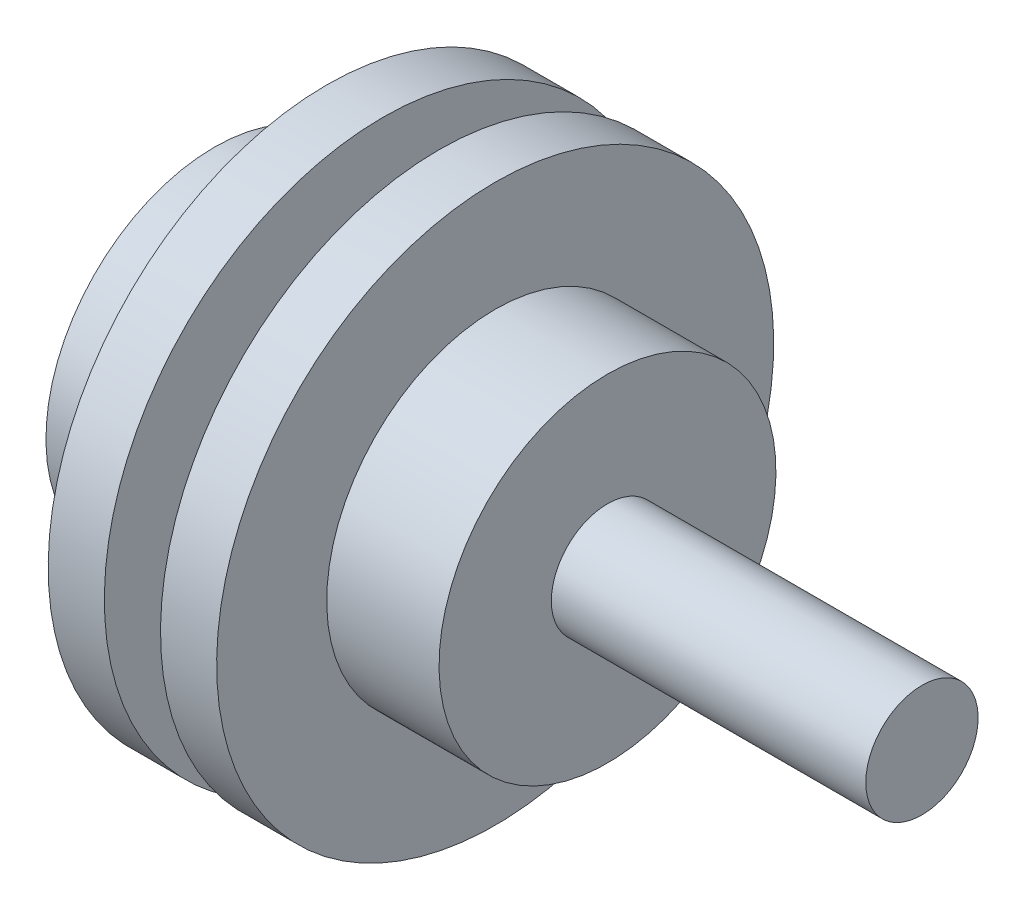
ISO-10303-21;
HEADER;
FILE_DESCRIPTION(('STEP AP214'),'2;1');
FILE_NAME('part.step','',(''),(''),'','','');
FILE_SCHEMA(('AUTOMOTIVE_DESIGN { 1 0 10303 214 1 1 1 1 }'));
ENDSEC;
DATA;
#1=APPLICATION_CONTEXT('core data for automotive mechanical design processes');
#2=APPLICATION_PROTOCOL_DEFINITION('international standard','automotive_design',2000,#1);
#3=PRODUCT_CONTEXT('',#1,'mechanical');
#4=PRODUCT('Part','Part','',(#3));
#5=PRODUCT_RELATED_PRODUCT_CATEGORY('part','',(#4));
#6=PRODUCT_DEFINITION_FORMATION('','',#4);
#7=PRODUCT_DEFINITION_CONTEXT('part definition',#1,'design');
#8=PRODUCT_DEFINITION('design','',#6,#7);
#9=PRODUCT_DEFINITION_SHAPE('','',#8);
#10=(LENGTH_UNIT() NAMED_UNIT(*) SI_UNIT(.MILLI.,.METRE.));
#11=(NAMED_UNIT(*) PLANE_ANGLE_UNIT() SI_UNIT($,.RADIAN.));
#12=(NAMED_UNIT(*) SI_UNIT($,.STERADIAN.) SOLID_ANGLE_UNIT());
#13=UNCERTAINTY_MEASURE_WITH_UNIT(LENGTH_MEASURE(1.E-05),#10,'distance_accuracy_value','');
#14=(GEOMETRIC_REPRESENTATION_CONTEXT(3) GLOBAL_UNCERTAINTY_ASSIGNED_CONTEXT((#13)) GLOBAL_UNIT_ASSIGNED_CONTEXT((#10,
#11,#12)) REPRESENTATION_CONTEXT('',''));
#15=CARTESIAN_POINT('',(0.,0.,0.));
#16=DIRECTION('',(0.,0.,1.));
#17=DIRECTION('',(1.,0.,0.));
#18=AXIS2_PLACEMENT_3D('',#15,#16,#17);
#19=CARTESIAN_POINT('',(-12.7,-19.05,0.));
#20=DIRECTION('',(0.999999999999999,0.,0.));
#21=DIRECTION('',(0.,1.,0.));
#22=AXIS2_PLACEMENT_3D('',#19,#20,#21);
#23=PLANE('',#22);
#24=CARTESIAN_POINT('',(-12.7,-19.05,0.));
#25=DIRECTION('',(0.999999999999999,0.,0.));
#26=DIRECTION('',(0.,1.,0.));
#27=AXIS2_PLACEMENT_3D('',#24,#25,#26);
#28=CIRCLE('',#27,19.05);
#29=CARTESIAN_POINT('',(-12.7,0.,0.));
#30=VERTEX_POINT('',#29);
#31=EDGE_CURVE('E47',#30,#30,#28,.T.);
#32=ORIENTED_EDGE('',*,*,#31,.F.);
#33=EDGE_LOOP('',(#32));
#34=FACE_BOUND('',#33,.T.);
#35=ADVANCED_FACE('F44',(#34),#23,.F.);
#36=CARTESIAN_POINT('',(31.7499999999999,-19.0499999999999,0.));
#37=DIRECTION('',(0.999999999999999,0.,0.));
#38=DIRECTION('',(0.,1.,0.));
#39=AXIS2_PLACEMENT_3D('',#36,#37,#38);
#40=CYLINDRICAL_SURFACE('',#39,19.05);
#41=CARTESIAN_POINT('',(0.,-19.05,0.));
#42=DIRECTION('',(0.999999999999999,0.,0.));
#43=DIRECTION('',(0.,1.,0.));
#44=AXIS2_PLACEMENT_3D('',#41,#42,#43);
#45=CIRCLE('',#44,19.05);
#46=CARTESIAN_POINT('',(0.,0.,0.));
#47=VERTEX_POINT('',#46);
#48=EDGE_CURVE('E55',#47,#47,#45,.T.);
#49=CARTESIAN_POINT('',(0.,0.,0.));
#50=CARTESIAN_POINT('',(-0.132291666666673,0.,0.));
#51=CARTESIAN_POINT('',(-0.264583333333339,0.,0.));
#52=CARTESIAN_POINT('',(-0.529166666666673,0.,0.));
#53=CARTESIAN_POINT('',(-0.661458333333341,0.,0.));
#54=CARTESIAN_POINT('',(-0.926041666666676,0.,0.));
#55=CARTESIAN_POINT('',(-1.05833333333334,0.,0.));
#56=CARTESIAN_POINT('',(-1.32291666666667,0.,0.));
#57=CARTESIAN_POINT('',(-1.45520833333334,0.,0.));
#58=CARTESIAN_POINT('',(-1.71979166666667,0.,0.));
#59=CARTESIAN_POINT('',(-1.85208333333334,0.,0.));
#60=CARTESIAN_POINT('',(-2.11666666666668,0.,0.));
#61=CARTESIAN_POINT('',(-2.24895833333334,0.,0.));
#62=CARTESIAN_POINT('',(-2.51354166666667,0.,0.));
#63=CARTESIAN_POINT('',(-2.64583333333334,0.,0.));
#64=CARTESIAN_POINT('',(-2.91041666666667,0.,0.));
#65=CARTESIAN_POINT('',(-3.04270833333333,0.,0.));
#66=CARTESIAN_POINT('',(-3.30729166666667,0.,0.));
#67=CARTESIAN_POINT('',(-3.43958333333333,0.,0.));
#68=CARTESIAN_POINT('',(-3.70416666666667,0.,0.));
#69=CARTESIAN_POINT('',(-3.83645833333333,0.,0.));
#70=CARTESIAN_POINT('',(-4.10104166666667,0.,0.));
#71=CARTESIAN_POINT('',(-4.23333333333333,0.,0.));
#72=CARTESIAN_POINT('',(-4.49791666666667,0.,0.));
#73=CARTESIAN_POINT('',(-4.63020833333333,0.,0.));
#74=CARTESIAN_POINT('',(-4.89479166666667,0.,0.));
#75=CARTESIAN_POINT('',(-5.02708333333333,0.,0.));
#76=CARTESIAN_POINT('',(-5.29166666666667,0.,0.));
#77=CARTESIAN_POINT('',(-5.42395833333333,0.,0.));
#78=CARTESIAN_POINT('',(-5.68854166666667,0.,0.));
#79=CARTESIAN_POINT('',(-5.82083333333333,0.,0.));
#80=CARTESIAN_POINT('',(-6.08541666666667,0.,0.));
#81=CARTESIAN_POINT('',(-6.21770833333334,0.,0.));
#82=CARTESIAN_POINT('',(-6.48229166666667,0.,0.));
#83=CARTESIAN_POINT('',(-6.61458333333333,0.,0.));
#84=CARTESIAN_POINT('',(-6.87916666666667,0.,0.));
#85=CARTESIAN_POINT('',(-7.01145833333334,0.,0.));
#86=CARTESIAN_POINT('',(-7.27604166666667,0.,0.));
#87=CARTESIAN_POINT('',(-7.40833333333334,0.,0.));
#88=CARTESIAN_POINT('',(-7.67291666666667,0.,0.));
#89=CARTESIAN_POINT('',(-7.80520833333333,0.,0.));
#90=CARTESIAN_POINT('',(-8.06979166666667,0.,0.));
#91=CARTESIAN_POINT('',(-8.20208333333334,0.,0.));
#92=CARTESIAN_POINT('',(-8.46666666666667,0.,0.));
#93=CARTESIAN_POINT('',(-8.59895833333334,0.,0.));
#94=CARTESIAN_POINT('',(-8.86354166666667,0.,0.));
#95=CARTESIAN_POINT('',(-8.99583333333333,0.,0.));
#96=CARTESIAN_POINT('',(-9.26041666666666,0.,0.));
#97=CARTESIAN_POINT('',(-9.39270833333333,0.,0.));
#98=CARTESIAN_POINT('',(-9.65729166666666,0.,0.));
#99=CARTESIAN_POINT('',(-9.78958333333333,0.,0.));
#100=CARTESIAN_POINT('',(-10.0541666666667,0.,0.));
#101=CARTESIAN_POINT('',(-10.1864583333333,0.,0.));
#102=CARTESIAN_POINT('',(-10.4510416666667,0.,0.));
#103=CARTESIAN_POINT('',(-10.5833333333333,0.,0.));
#104=CARTESIAN_POINT('',(-10.8479166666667,0.,0.));
#105=CARTESIAN_POINT('',(-10.9802083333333,0.,0.));
#106=CARTESIAN_POINT('',(-11.2447916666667,0.,0.));
#107=CARTESIAN_POINT('',(-11.3770833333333,0.,0.));
#108=CARTESIAN_POINT('',(-11.6416666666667,0.,0.));
#109=CARTESIAN_POINT('',(-11.7739583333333,0.,0.));
#110=CARTESIAN_POINT('',(-12.0385416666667,0.,0.));
#111=CARTESIAN_POINT('',(-12.1708333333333,0.,0.));
#112=CARTESIAN_POINT('',(-12.4354166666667,0.,0.));
#113=CARTESIAN_POINT('',(-12.5677083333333,0.,0.));
#114=CARTESIAN_POINT('',(-12.7,0.,0.));
#115=B_SPLINE_CURVE_WITH_KNOTS('',3,(#49,#50,#51,#52,#53,#54,#55,#56,#57,#58,#59,#60,#61,#62,
#63,#64,#65,#66,#67,#68,#69,#70,#71,#72,#73,#74,#75,#76,#77,#78,#79,#80,#81,#82,#83,#84,#85,#86,
#87,#88,#89,#90,#91,#92,#93,#94,#95,#96,#97,#98,#99,#100,#101,#102,#103,#104,#105,#106,#107,
#108,#109,#110,#111,#112,#113,#114),.UNSPECIFIED.,.F.,.F.,(4,2,2,2,2,2,2,2,2,2,2,2,2,2,2,2,2,2,
2,2,2,2,2,2,2,2,2,2,2,2,2,2,4),(0.,0.396874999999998,0.793750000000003,1.190625,1.5875,1.984375,
2.38125,2.77812499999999,3.17499999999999,3.571875,3.96874999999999,4.36562499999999,4.7625,
5.15937499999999,5.55624999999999,5.953125,6.34999999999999,6.74687499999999,7.14375,7.540625,
7.93749999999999,8.334375,8.73125,9.12812499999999,9.52499999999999,9.92187499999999,10.31875,
10.715625,11.1125,11.509375,11.90625,12.303125,12.7),.UNSPECIFIED.);
#116=EDGE_CURVE('BSEAM87',#47,#30,#115,.T.);
#117=ORIENTED_EDGE('',*,*,#48,.F.);
#118=ORIENTED_EDGE('',*,*,#31,.T.);
#119=ORIENTED_EDGE('',*,*,#116,.T.);
#120=ORIENTED_EDGE('',*,*,#116,.F.);
#121=EDGE_LOOP('',(#117,#119,#118,#120));
#122=FACE_BOUND('',#121,.T.);
#123=ADVANCED_FACE('F87',(#122),#40,.T.);
#124=CARTESIAN_POINT('',(0.,0.,0.));
#125=DIRECTION('',(0.999999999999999,0.,0.));
#126=DIRECTION('',(0.,1.,0.));
#127=AXIS2_PLACEMENT_3D('',#124,#125,#126);
#128=PLANE('',#127);
#129=CARTESIAN_POINT('',(0.,-19.05,0.));
#130=DIRECTION('',(0.999999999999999,0.,0.));
#131=DIRECTION('',(0.,1.,0.));
#132=AXIS2_PLACEMENT_3D('',#129,#130,#131);
#133=CIRCLE('',#132,31.496);
#134=CARTESIAN_POINT('',(0.,12.4460000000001,0.));
#135=VERTEX_POINT('',#134);
#136=EDGE_CURVE('E80',#135,#135,#133,.T.);
#137=ORIENTED_EDGE('',*,*,#136,.F.);
#138=EDGE_LOOP('',(#137));
#139=FACE_BOUND('',#138,.T.);
#140=ORIENTED_EDGE('',*,*,#48,.T.);
#141=EDGE_LOOP('',(#140));
#142=FACE_BOUND('',#141,.T.);
#143=ADVANCED_FACE('F85',(#139,#142),#128,.F.);
#144=CARTESIAN_POINT('',(31.7499999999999,-19.0499999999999,0.));
#145=DIRECTION('',(0.999999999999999,0.,0.));
#146=DIRECTION('',(0.,1.,0.));
#147=AXIS2_PLACEMENT_3D('',#144,#145,#146);
#148=CYLINDRICAL_SURFACE('',#147,31.496);
#149=CARTESIAN_POINT('',(6.35000000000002,-19.05,0.));
#150=DIRECTION('',(0.999999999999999,0.,0.));
#151=DIRECTION('',(0.,1.,0.));
#152=AXIS2_PLACEMENT_3D('',#149,#150,#151);
#153=CIRCLE('',#152,31.496);
#154=CARTESIAN_POINT('',(6.35000000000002,12.4460000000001,0.));
#155=VERTEX_POINT('',#154);
#156=EDGE_CURVE('E77',#155,#155,#153,.T.);
#157=CARTESIAN_POINT('',(6.35000000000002,12.4460000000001,0.));
#158=CARTESIAN_POINT('',(6.28385416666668,12.4460000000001,0.));
#159=CARTESIAN_POINT('',(6.21770833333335,12.4460000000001,0.));
#160=CARTESIAN_POINT('',(6.08541666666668,12.4460000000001,0.));
#161=CARTESIAN_POINT('',(6.01927083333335,12.4460000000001,0.));
#162=CARTESIAN_POINT('',(5.88697916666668,12.4460000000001,0.));
#163=CARTESIAN_POINT('',(5.82083333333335,12.4460000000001,0.));
#164=CARTESIAN_POINT('',(5.68854166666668,12.4460000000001,0.));
#165=CARTESIAN_POINT('',(5.62239583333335,12.4460000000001,0.));
#166=CARTESIAN_POINT('',(5.49010416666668,12.4460000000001,0.));
#167=CARTESIAN_POINT('',(5.42395833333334,12.4460000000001,0.));
#168=CARTESIAN_POINT('',(5.29166666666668,12.4460000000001,0.));
#169=CARTESIAN_POINT('',(5.22552083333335,12.4460000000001,0.));
#170=CARTESIAN_POINT('',(5.09322916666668,12.4460000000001,0.));
#171=CARTESIAN_POINT('',(5.02708333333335,12.4460000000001,0.));
#172=CARTESIAN_POINT('',(4.89479166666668,12.4460000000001,0.));
#173=CARTESIAN_POINT('',(4.82864583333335,12.4460000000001,0.));
#174=CARTESIAN_POINT('',(4.69635416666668,12.4460000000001,0.));
#175=CARTESIAN_POINT('',(4.63020833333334,12.4460000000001,0.));
#176=CARTESIAN_POINT('',(4.49791666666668,12.4460000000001,0.));
#177=CARTESIAN_POINT('',(4.43177083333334,12.4460000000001,0.));
#178=CARTESIAN_POINT('',(4.29947916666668,12.4460000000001,0.));
#179=CARTESIAN_POINT('',(4.23333333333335,12.4460000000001,0.));
#180=CARTESIAN_POINT('',(4.10104166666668,12.4460000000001,0.));
#181=CARTESIAN_POINT('',(4.03489583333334,12.4460000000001,0.));
#182=CARTESIAN_POINT('',(3.90260416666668,12.4460000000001,0.));
#183=CARTESIAN_POINT('',(3.83645833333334,12.4460000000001,0.));
#184=CARTESIAN_POINT('',(3.70416666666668,12.4460000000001,0.));
#185=CARTESIAN_POINT('',(3.63802083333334,12.4460000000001,0.));
#186=CARTESIAN_POINT('',(3.50572916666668,12.4460000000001,0.));
#187=CARTESIAN_POINT('',(3.43958333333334,12.4460000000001,0.));
#188=CARTESIAN_POINT('',(3.30729166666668,12.4460000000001,0.));
#189=CARTESIAN_POINT('',(3.24114583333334,12.4460000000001,0.));
#190=CARTESIAN_POINT('',(3.10885416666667,12.4460000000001,0.));
#191=CARTESIAN_POINT('',(3.04270833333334,12.4460000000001,0.));
#192=CARTESIAN_POINT('',(2.91041666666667,12.4460000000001,0.));
#193=CARTESIAN_POINT('',(2.84427083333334,12.4460000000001,0.));
#194=CARTESIAN_POINT('',(2.71197916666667,12.4460000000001,0.));
#195=CARTESIAN_POINT('',(2.64583333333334,12.4460000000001,0.));
#196=CARTESIAN_POINT('',(2.51354166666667,12.4460000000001,0.));
#197=CARTESIAN_POINT('',(2.44739583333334,12.4460000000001,0.));
#198=CARTESIAN_POINT('',(2.31510416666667,12.4460000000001,0.));
#199=CARTESIAN_POINT('',(2.24895833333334,12.4460000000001,0.));
#200=CARTESIAN_POINT('',(2.11666666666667,12.4460000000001,0.));
#201=CARTESIAN_POINT('',(2.05052083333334,12.4460000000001,0.));
#202=CARTESIAN_POINT('',(1.91822916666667,12.4460000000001,0.));
#203=CARTESIAN_POINT('',(1.85208333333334,12.4460000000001,0.));
#204=CARTESIAN_POINT('',(1.71979166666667,12.4460000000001,0.));
#205=CARTESIAN_POINT('',(1.65364583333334,12.4460000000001,0.));
#206=CARTESIAN_POINT('',(1.52135416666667,12.4460000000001,0.));
#207=CARTESIAN_POINT('',(1.45520833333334,12.4460000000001,0.));
#208=CARTESIAN_POINT('',(1.32291666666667,12.4460000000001,0.));
#209=CARTESIAN_POINT('',(1.25677083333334,12.4460000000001,0.));
#210=CARTESIAN_POINT('',(1.12447916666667,12.4460000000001,0.));
#211=CARTESIAN_POINT('',(1.05833333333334,12.4460000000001,0.));
#212=CARTESIAN_POINT('',(0.926041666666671,12.4460000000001,0.));
#213=CARTESIAN_POINT('',(0.859895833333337,12.4460000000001,0.));
#214=CARTESIAN_POINT('',(0.727604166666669,12.4460000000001,0.));
#215=CARTESIAN_POINT('',(0.661458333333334,12.4460000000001,0.));
#216=CARTESIAN_POINT('',(0.529166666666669,12.4460000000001,0.));
#217=CARTESIAN_POINT('',(0.463020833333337,12.4460000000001,0.));
#218=CARTESIAN_POINT('',(0.330729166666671,12.4460000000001,0.));
#219=CARTESIAN_POINT('',(0.264583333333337,12.4460000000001,0.));
#220=CARTESIAN_POINT('',(0.132291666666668,12.4460000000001,0.));
#221=CARTESIAN_POINT('',(0.0661458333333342,12.4460000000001,0.));
#222=CARTESIAN_POINT('',(0.,12.4460000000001,0.));
#223=B_SPLINE_CURVE_WITH_KNOTS('',3,(#157,#158,#159,#160,#161,#162,#163,#164,#165,#166,#167,
#168,#169,#170,#171,#172,#173,#174,#175,#176,#177,#178,#179,#180,#181,#182,#183,#184,#185,#186,
#187,#188,#189,#190,#191,#192,#193,#194,#195,#196,#197,#198,#199,#200,#201,#202,#203,#204,#205,
#206,#207,#208,#209,#210,#211,#212,#213,#214,#215,#216,#217,#218,#219,#220,#221,#222),
.UNSPECIFIED.,.F.,.F.,(4,2,2,2,2,2,2,2,2,2,2,2,2,2,2,2,2,2,2,2,2,2,2,2,2,2,2,2,2,2,2,2,4),(0.,
0.198437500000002,0.396875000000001,0.5953125,0.793750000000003,0.992187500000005,1.190625,
1.3890625,1.5875,1.7859375,1.984375,2.1828125,2.38125,2.57968750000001,2.77812500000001,
2.97656250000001,3.17500000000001,3.37343750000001,3.57187500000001,3.77031250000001,
3.96875000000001,4.16718750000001,4.36562500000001,4.56406250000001,4.76250000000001,
4.96093750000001,5.15937500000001,5.35781250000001,5.55625000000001,5.75468750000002,
5.95312500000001,6.15156250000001,6.35000000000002),.UNSPECIFIED.);
#224=EDGE_CURVE('BSEAM105',#155,#135,#223,.T.);
#225=ORIENTED_EDGE('',*,*,#156,.F.);
#226=ORIENTED_EDGE('',*,*,#136,.T.);
#227=ORIENTED_EDGE('',*,*,#224,.T.);
#228=ORIENTED_EDGE('',*,*,#224,.F.);
#229=EDGE_LOOP('',(#225,#227,#226,#228));
#230=FACE_BOUND('',#229,.T.);
#231=ADVANCED_FACE('F105',(#230),#148,.T.);
#232=CARTESIAN_POINT('',(6.35000000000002,12.446,0.));
#233=DIRECTION('',(-0.999999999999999,0.,0.));
#234=DIRECTION('',(0.,-1.,0.));
#235=AXIS2_PLACEMENT_3D('',#232,#233,#234);
#236=PLANE('',#235);
#237=CARTESIAN_POINT('',(6.35000000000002,-19.05,0.));
#238=DIRECTION('',(0.999999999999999,0.,0.));
#239=DIRECTION('',(0.,1.,0.));
#240=AXIS2_PLACEMENT_3D('',#237,#238,#239);
#241=CIRCLE('',#240,19.05);
#242=CARTESIAN_POINT('',(6.35000000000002,0.,0.));
#243=VERTEX_POINT('',#242);
#244=EDGE_CURVE('E74',#243,#243,#241,.T.);
#245=ORIENTED_EDGE('',*,*,#244,.F.);
#246=EDGE_LOOP('',(#245));
#247=FACE_BOUND('',#246,.T.);
#248=ORIENTED_EDGE('',*,*,#156,.T.);
#249=EDGE_LOOP('',(#248));
#250=FACE_BOUND('',#249,.T.);
#251=ADVANCED_FACE('F113',(#247,#250),#236,.F.);
#252=CARTESIAN_POINT('',(31.7499999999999,-19.0499999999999,0.));
#253=DIRECTION('',(0.999999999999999,0.,0.));
#254=DIRECTION('',(0.,1.,0.));
#255=AXIS2_PLACEMENT_3D('',#252,#253,#254);
#256=CYLINDRICAL_SURFACE('',#255,19.05);
#257=CARTESIAN_POINT('',(12.7,-19.05,0.));
#258=DIRECTION('',(0.999999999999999,0.,0.));
#259=DIRECTION('',(0.,1.,0.));
#260=AXIS2_PLACEMENT_3D('',#257,#258,#259);
#261=CIRCLE('',#260,19.05);
#262=CARTESIAN_POINT('',(12.7,0.,0.));
#263=VERTEX_POINT('',#262);
#264=EDGE_CURVE('E71',#263,#263,#261,.T.);
#265=CARTESIAN_POINT('',(12.7,0.,0.));
#266=CARTESIAN_POINT('',(12.6338541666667,0.,0.));
#267=CARTESIAN_POINT('',(12.5677083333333,0.,0.));
#268=CARTESIAN_POINT('',(12.4354166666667,0.,0.));
#269=CARTESIAN_POINT('',(12.3692708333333,0.,0.));
#270=CARTESIAN_POINT('',(12.2369791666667,0.,0.));
#271=CARTESIAN_POINT('',(12.1708333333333,0.,0.));
#272=CARTESIAN_POINT('',(12.0385416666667,0.,0.));
#273=CARTESIAN_POINT('',(11.9723958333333,0.,0.));
#274=CARTESIAN_POINT('',(11.8401041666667,0.,0.));
#275=CARTESIAN_POINT('',(11.7739583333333,0.,0.));
#276=CARTESIAN_POINT('',(11.6416666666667,0.,0.));
#277=CARTESIAN_POINT('',(11.5755208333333,0.,0.));
#278=CARTESIAN_POINT('',(11.4432291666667,0.,0.));
#279=CARTESIAN_POINT('',(11.3770833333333,0.,0.));
#280=CARTESIAN_POINT('',(11.2447916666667,0.,0.));
#281=CARTESIAN_POINT('',(11.1786458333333,0.,0.));
#282=CARTESIAN_POINT('',(11.0463541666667,0.,0.));
#283=CARTESIAN_POINT('',(10.9802083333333,0.,0.));
#284=CARTESIAN_POINT('',(10.8479166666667,0.,0.));
#285=CARTESIAN_POINT('',(10.7817708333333,0.,0.));
#286=CARTESIAN_POINT('',(10.6494791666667,0.,0.));
#287=CARTESIAN_POINT('',(10.5833333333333,0.,0.));
#288=CARTESIAN_POINT('',(10.4510416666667,0.,0.));
#289=CARTESIAN_POINT('',(10.3848958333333,0.,0.));
#290=CARTESIAN_POINT('',(10.2526041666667,0.,0.));
#291=CARTESIAN_POINT('',(10.1864583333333,0.,0.));
#292=CARTESIAN_POINT('',(10.0541666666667,0.,0.));
#293=CARTESIAN_POINT('',(9.98802083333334,0.,0.));
#294=CARTESIAN_POINT('',(9.85572916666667,0.,0.));
#295=CARTESIAN_POINT('',(9.78958333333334,0.,0.));
#296=CARTESIAN_POINT('',(9.65729166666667,0.,0.));
#297=CARTESIAN_POINT('',(9.59114583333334,0.,0.));
#298=CARTESIAN_POINT('',(9.45885416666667,0.,0.));
#299=CARTESIAN_POINT('',(9.39270833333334,0.,0.));
#300=CARTESIAN_POINT('',(9.26041666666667,0.,0.));
#301=CARTESIAN_POINT('',(9.19427083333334,0.,0.));
#302=CARTESIAN_POINT('',(9.06197916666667,0.,0.));
#303=CARTESIAN_POINT('',(8.99583333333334,0.,0.));
#304=CARTESIAN_POINT('',(8.86354166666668,0.,0.));
#305=CARTESIAN_POINT('',(8.79739583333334,0.,0.));
#306=CARTESIAN_POINT('',(8.66510416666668,0.,0.));
#307=CARTESIAN_POINT('',(8.59895833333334,0.,0.));
#308=CARTESIAN_POINT('',(8.46666666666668,0.,0.));
#309=CARTESIAN_POINT('',(8.40052083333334,0.,0.));
#310=CARTESIAN_POINT('',(8.26822916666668,0.,0.));
#311=CARTESIAN_POINT('',(8.20208333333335,0.,0.));
#312=CARTESIAN_POINT('',(8.06979166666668,0.,0.));
#313=CARTESIAN_POINT('',(8.00364583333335,0.,0.));
#314=CARTESIAN_POINT('',(7.87135416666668,0.,0.));
#315=CARTESIAN_POINT('',(7.80520833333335,0.,0.));
#316=CARTESIAN_POINT('',(7.67291666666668,0.,0.));
#317=CARTESIAN_POINT('',(7.60677083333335,0.,0.));
#318=CARTESIAN_POINT('',(7.47447916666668,0.,0.));
#319=CARTESIAN_POINT('',(7.40833333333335,0.,0.));
#320=CARTESIAN_POINT('',(7.27604166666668,0.,0.));
#321=CARTESIAN_POINT('',(7.20989583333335,0.,0.));
#322=CARTESIAN_POINT('',(7.07760416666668,0.,0.));
#323=CARTESIAN_POINT('',(7.01145833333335,0.,0.));
#324=CARTESIAN_POINT('',(6.87916666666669,0.,0.));
#325=CARTESIAN_POINT('',(6.81302083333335,0.,0.));
#326=CARTESIAN_POINT('',(6.68072916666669,0.,0.));
#327=CARTESIAN_POINT('',(6.61458333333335,0.,0.));
#328=CARTESIAN_POINT('',(6.48229166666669,0.,0.));
#329=CARTESIAN_POINT('',(6.41614583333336,0.,0.));
#330=CARTESIAN_POINT('',(6.35000000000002,0.,0.));
#331=B_SPLINE_CURVE_WITH_KNOTS('',3,(#265,#266,#267,#268,#269,#270,#271,#272,#273,#274,#275,
#276,#277,#278,#279,#280,#281,#282,#283,#284,#285,#286,#287,#288,#289,#290,#291,#292,#293,#294,
#295,#296,#297,#298,#299,#300,#301,#302,#303,#304,#305,#306,#307,#308,#309,#310,#311,#312,#313,
#314,#315,#316,#317,#318,#319,#320,#321,#322,#323,#324,#325,#326,#327,#328,#329,#330),
.UNSPECIFIED.,.F.,.F.,(4,2,2,2,2,2,2,2,2,2,2,2,2,2,2,2,2,2,2,2,2,2,2,2,2,2,2,2,2,2,2,2,4),(0.,
0.198437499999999,0.396874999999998,0.595312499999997,0.793749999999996,0.992187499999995,
1.19062499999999,1.38906249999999,1.58749999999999,1.78593749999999,1.98437499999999,
2.18281249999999,2.38124999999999,2.57968749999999,2.77812499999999,2.97656249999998,
3.17499999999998,3.37343749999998,3.57187499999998,3.77031249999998,3.96874999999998,
4.16718749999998,4.36562499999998,4.56406249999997,4.76249999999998,4.96093749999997,
5.15937499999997,5.35781249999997,5.55624999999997,5.75468749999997,5.95312499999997,
6.15156249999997,6.34999999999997),.UNSPECIFIED.);
#332=EDGE_CURVE('BSEAM122',#263,#243,#331,.T.);
#333=ORIENTED_EDGE('',*,*,#264,.F.);
#334=ORIENTED_EDGE('',*,*,#244,.T.);
#335=ORIENTED_EDGE('',*,*,#332,.T.);
#336=ORIENTED_EDGE('',*,*,#332,.F.);
#337=EDGE_LOOP('',(#333,#335,#334,#336));
#338=FACE_BOUND('',#337,.T.);
#339=ADVANCED_FACE('F122',(#338),#256,.T.);
#340=CARTESIAN_POINT('',(12.7,0.,0.));
#341=DIRECTION('',(0.999999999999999,0.,0.));
#342=DIRECTION('',(0.,1.,0.));
#343=AXIS2_PLACEMENT_3D('',#340,#341,#342);
#344=PLANE('',#343);
#345=CARTESIAN_POINT('',(12.7,-19.05,0.));
#346=DIRECTION('',(0.999999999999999,0.,0.));
#347=DIRECTION('',(0.,1.,0.));
#348=AXIS2_PLACEMENT_3D('',#345,#346,#347);
#349=CIRCLE('',#348,31.496);
#350=CARTESIAN_POINT('',(12.7,12.4460000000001,0.));
#351=VERTEX_POINT('',#350);
#352=EDGE_CURVE('E68',#351,#351,#349,.T.);
#353=ORIENTED_EDGE('',*,*,#352,.F.);
#354=EDGE_LOOP('',(#353));
#355=FACE_BOUND('',#354,.T.);
#356=ORIENTED_EDGE('',*,*,#264,.T.);
#357=EDGE_LOOP('',(#356));
#358=FACE_BOUND('',#357,.T.);
#359=ADVANCED_FACE('F131',(#355,#358),#344,.F.);
#360=CARTESIAN_POINT('',(31.7499999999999,-19.0499999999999,0.));
#361=DIRECTION('',(0.999999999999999,0.,0.));
#362=DIRECTION('',(0.,1.,0.));
#363=AXIS2_PLACEMENT_3D('',#360,#361,#362);
#364=CYLINDRICAL_SURFACE('',#363,31.496);
#365=CARTESIAN_POINT('',(19.05,-19.05,0.));
#366=DIRECTION('',(0.999999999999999,0.,0.));
#367=DIRECTION('',(0.,1.,0.));
#368=AXIS2_PLACEMENT_3D('',#365,#366,#367);
#369=CIRCLE('',#368,31.496);
#370=CARTESIAN_POINT('',(19.05,12.4460000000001,0.));
#371=VERTEX_POINT('',#370);
#372=EDGE_CURVE('E65',#371,#371,#369,.T.);
#373=CARTESIAN_POINT('',(19.05,12.4460000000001,0.));
#374=CARTESIAN_POINT('',(18.9838541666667,12.4460000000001,0.));
#375=CARTESIAN_POINT('',(18.9177083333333,12.4460000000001,0.));
#376=CARTESIAN_POINT('',(18.7854166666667,12.4460000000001,0.));
#377=CARTESIAN_POINT('',(18.7192708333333,12.4460000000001,0.));
#378=CARTESIAN_POINT('',(18.5869791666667,12.4460000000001,0.));
#379=CARTESIAN_POINT('',(18.5208333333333,12.4460000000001,0.));
#380=CARTESIAN_POINT('',(18.3885416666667,12.4460000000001,0.));
#381=CARTESIAN_POINT('',(18.3223958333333,12.4460000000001,0.));
#382=CARTESIAN_POINT('',(18.1901041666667,12.4460000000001,0.));
#383=CARTESIAN_POINT('',(18.1239583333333,12.4460000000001,0.));
#384=CARTESIAN_POINT('',(17.9916666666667,12.4460000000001,0.));
#385=CARTESIAN_POINT('',(17.9255208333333,12.4460000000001,0.));
#386=CARTESIAN_POINT('',(17.7932291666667,12.4460000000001,0.));
#387=CARTESIAN_POINT('',(17.7270833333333,12.4460000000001,0.));
#388=CARTESIAN_POINT('',(17.5947916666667,12.4460000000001,0.));
#389=CARTESIAN_POINT('',(17.5286458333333,12.4460000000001,0.));
#390=CARTESIAN_POINT('',(17.3963541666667,12.4460000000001,0.));
#391=CARTESIAN_POINT('',(17.3302083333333,12.4460000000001,0.));
#392=CARTESIAN_POINT('',(17.1979166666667,12.4460000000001,0.));
#393=CARTESIAN_POINT('',(17.1317708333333,12.4460000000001,0.));
#394=CARTESIAN_POINT('',(16.9994791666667,12.4460000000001,0.));
#395=CARTESIAN_POINT('',(16.9333333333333,12.4460000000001,0.));
#396=CARTESIAN_POINT('',(16.8010416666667,12.4460000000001,0.));
#397=CARTESIAN_POINT('',(16.7348958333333,12.4460000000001,0.));
#398=CARTESIAN_POINT('',(16.6026041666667,12.4460000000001,0.));
#399=CARTESIAN_POINT('',(16.5364583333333,12.4460000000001,0.));
#400=CARTESIAN_POINT('',(16.4041666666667,12.4460000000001,0.));
#401=CARTESIAN_POINT('',(16.3380208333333,12.4460000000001,0.));
#402=CARTESIAN_POINT('',(16.2057291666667,12.4460000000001,0.));
#403=CARTESIAN_POINT('',(16.1395833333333,12.4460000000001,0.));
#404=CARTESIAN_POINT('',(16.0072916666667,12.4460000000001,0.));
#405=CARTESIAN_POINT('',(15.9411458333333,12.4460000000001,0.));
#406=CARTESIAN_POINT('',(15.8088541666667,12.4460000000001,0.));
#407=CARTESIAN_POINT('',(15.7427083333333,12.4460000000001,0.));
#408=CARTESIAN_POINT('',(15.6104166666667,12.4460000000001,0.));
#409=CARTESIAN_POINT('',(15.5442708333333,12.4460000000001,0.));
#410=CARTESIAN_POINT('',(15.4119791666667,12.4460000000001,0.));
#411=CARTESIAN_POINT('',(15.3458333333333,12.4460000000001,0.));
#412=CARTESIAN_POINT('',(15.2135416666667,12.4460000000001,0.));
#413=CARTESIAN_POINT('',(15.1473958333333,12.4460000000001,0.));
#414=CARTESIAN_POINT('',(15.0151041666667,12.4460000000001,0.));
#415=CARTESIAN_POINT('',(14.9489583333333,12.4460000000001,0.));
#416=CARTESIAN_POINT('',(14.8166666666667,12.4460000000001,0.));
#417=CARTESIAN_POINT('',(14.7505208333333,12.4460000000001,0.));
#418=CARTESIAN_POINT('',(14.6182291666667,12.4460000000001,0.));
#419=CARTESIAN_POINT('',(14.5520833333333,12.4460000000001,0.));
#420=CARTESIAN_POINT('',(14.4197916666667,12.4460000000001,0.));
#421=CARTESIAN_POINT('',(14.3536458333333,12.4460000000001,0.));
#422=CARTESIAN_POINT('',(14.2213541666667,12.4460000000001,0.));
#423=CARTESIAN_POINT('',(14.1552083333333,12.4460000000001,0.));
#424=CARTESIAN_POINT('',(14.0229166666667,12.4460000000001,0.));
#425=CARTESIAN_POINT('',(13.9567708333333,12.4460000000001,0.));
#426=CARTESIAN_POINT('',(13.8244791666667,12.4460000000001,0.));
#427=CARTESIAN_POINT('',(13.7583333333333,12.4460000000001,0.));
#428=CARTESIAN_POINT('',(13.6260416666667,12.4460000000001,0.));
#429=CARTESIAN_POINT('',(13.5598958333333,12.4460000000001,0.));
#430=CARTESIAN_POINT('',(13.4276041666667,12.4460000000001,0.));
#431=CARTESIAN_POINT('',(13.3614583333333,12.4460000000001,0.));
#432=CARTESIAN_POINT('',(13.2291666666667,12.4460000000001,0.));
#433=CARTESIAN_POINT('',(13.1630208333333,12.4460000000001,0.));
#434=CARTESIAN_POINT('',(13.0307291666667,12.4460000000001,0.));
#435=CARTESIAN_POINT('',(12.9645833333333,12.4460000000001,0.));
#436=CARTESIAN_POINT('',(12.8322916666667,12.4460000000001,0.));
#437=CARTESIAN_POINT('',(12.7661458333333,12.4460000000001,0.));
#438=CARTESIAN_POINT('',(12.7,12.4460000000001,0.));
#439=B_SPLINE_CURVE_WITH_KNOTS('',3,(#373,#374,#375,#376,#377,#378,#379,#380,#381,#382,#383,
#384,#385,#386,#387,#388,#389,#390,#391,#392,#393,#394,#395,#396,#397,#398,#399,#400,#401,#402,
#403,#404,#405,#406,#407,#408,#409,#410,#411,#412,#413,#414,#415,#416,#417,#418,#419,#420,#421,
#422,#423,#424,#425,#426,#427,#428,#429,#430,#431,#432,#433,#434,#435,#436,#437,#438),
.UNSPECIFIED.,.F.,.F.,(4,2,2,2,2,2,2,2,2,2,2,2,2,2,2,2,2,2,2,2,2,2,2,2,2,2,2,2,2,2,2,2,4),(0.,
0.198437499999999,0.396875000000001,0.595312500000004,0.793750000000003,0.992187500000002,
1.190625,1.38906250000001,1.58750000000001,1.78593750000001,1.98437500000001,2.18281250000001,
2.38125000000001,2.57968750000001,2.77812500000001,2.97656250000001,3.17500000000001,
3.37343750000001,3.57187500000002,3.77031250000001,3.96875000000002,4.16718750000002,
4.36562500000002,4.56406250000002,4.76250000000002,4.96093750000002,5.15937500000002,
5.35781250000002,5.55625000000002,5.75468750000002,5.95312500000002,6.15156250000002,
6.35000000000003),.UNSPECIFIED.);
#440=EDGE_CURVE('BSEAM140',#371,#351,#439,.T.);
#441=ORIENTED_EDGE('',*,*,#372,.F.);
#442=ORIENTED_EDGE('',*,*,#352,.T.);
#443=ORIENTED_EDGE('',*,*,#440,.T.);
#444=ORIENTED_EDGE('',*,*,#440,.F.);
#445=EDGE_LOOP('',(#441,#443,#442,#444));
#446=FACE_BOUND('',#445,.T.);
#447=ADVANCED_FACE('F140',(#446),#364,.T.);
#448=CARTESIAN_POINT('',(19.05,12.446,0.));
#449=DIRECTION('',(-0.999999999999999,0.,0.));
#450=DIRECTION('',(0.,-1.,0.));
#451=AXIS2_PLACEMENT_3D('',#448,#449,#450);
#452=PLANE('',#451);
#453=CARTESIAN_POINT('',(19.05,-19.05,0.));
#454=DIRECTION('',(0.999999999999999,0.,0.));
#455=DIRECTION('',(0.,1.,0.));
#456=AXIS2_PLACEMENT_3D('',#453,#454,#455);
#457=CIRCLE('',#456,19.05);
#458=CARTESIAN_POINT('',(19.05,0.,0.));
#459=VERTEX_POINT('',#458);
#460=EDGE_CURVE('E62',#459,#459,#457,.T.);
#461=ORIENTED_EDGE('',*,*,#460,.F.);
#462=EDGE_LOOP('',(#461));
#463=FACE_BOUND('',#462,.T.);
#464=ORIENTED_EDGE('',*,*,#372,.T.);
#465=EDGE_LOOP('',(#464));
#466=FACE_BOUND('',#465,.T.);
#467=ADVANCED_FACE('F147',(#463,#466),#452,.F.);
#468=CARTESIAN_POINT('',(31.7499999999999,-19.0499999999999,0.));
#469=DIRECTION('',(0.999999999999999,0.,0.));
#470=DIRECTION('',(0.,1.,0.));
#471=AXIS2_PLACEMENT_3D('',#468,#469,#470);
#472=CYLINDRICAL_SURFACE('',#471,19.05);
#473=CARTESIAN_POINT('',(31.7499999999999,-19.0499999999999,0.));
#474=DIRECTION('',(0.999999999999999,0.,0.));
#475=DIRECTION('',(0.,1.,0.));
#476=AXIS2_PLACEMENT_3D('',#473,#474,#475);
#477=CIRCLE('',#476,19.05);
#478=CARTESIAN_POINT('',(31.7499999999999,0.,0.));
#479=VERTEX_POINT('',#478);
#480=EDGE_CURVE('E59',#479,#479,#477,.T.);
#481=CARTESIAN_POINT('',(31.7499999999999,0.,0.));
#482=CARTESIAN_POINT('',(31.6177083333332,0.,0.));
#483=CARTESIAN_POINT('',(31.4854166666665,0.,0.));
#484=CARTESIAN_POINT('',(31.2208333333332,0.,0.));
#485=CARTESIAN_POINT('',(31.0885416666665,0.,0.));
#486=CARTESIAN_POINT('',(30.8239583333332,0.,0.));
#487=CARTESIAN_POINT('',(30.6916666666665,0.,0.));
#488=CARTESIAN_POINT('',(30.4270833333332,0.,0.));
#489=CARTESIAN_POINT('',(30.2947916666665,0.,0.));
#490=CARTESIAN_POINT('',(30.0302083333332,0.,0.));
#491=CARTESIAN_POINT('',(29.8979166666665,0.,0.));
#492=CARTESIAN_POINT('',(29.6333333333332,0.,0.));
#493=CARTESIAN_POINT('',(29.5010416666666,0.,0.));
#494=CARTESIAN_POINT('',(29.2364583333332,0.,0.));
#495=CARTESIAN_POINT('',(29.1041666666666,0.,0.));
#496=CARTESIAN_POINT('',(28.8395833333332,0.,0.));
#497=CARTESIAN_POINT('',(28.7072916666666,0.,0.));
#498=CARTESIAN_POINT('',(28.4427083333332,0.,0.));
#499=CARTESIAN_POINT('',(28.3104166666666,0.,0.));
#500=CARTESIAN_POINT('',(28.0458333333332,0.,0.));
#501=CARTESIAN_POINT('',(27.9135416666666,0.,0.));
#502=CARTESIAN_POINT('',(27.6489583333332,0.,0.));
#503=CARTESIAN_POINT('',(27.5166666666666,0.,0.));
#504=CARTESIAN_POINT('',(27.2520833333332,0.,0.));
#505=CARTESIAN_POINT('',(27.1197916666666,0.,0.));
#506=CARTESIAN_POINT('',(26.8552083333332,0.,0.));
#507=CARTESIAN_POINT('',(26.7229166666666,0.,0.));
#508=CARTESIAN_POINT('',(26.4583333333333,0.,0.));
#509=CARTESIAN_POINT('',(26.3260416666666,0.,0.));
#510=CARTESIAN_POINT('',(26.0614583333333,0.,0.));
#511=CARTESIAN_POINT('',(25.9291666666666,0.,0.));
#512=CARTESIAN_POINT('',(25.6645833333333,0.,0.));
#513=CARTESIAN_POINT('',(25.5322916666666,0.,0.));
#514=CARTESIAN_POINT('',(25.2677083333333,0.,0.));
#515=CARTESIAN_POINT('',(25.1354166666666,0.,0.));
#516=CARTESIAN_POINT('',(24.8708333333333,0.,0.));
#517=CARTESIAN_POINT('',(24.7385416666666,0.,0.));
#518=CARTESIAN_POINT('',(24.4739583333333,0.,0.));
#519=CARTESIAN_POINT('',(24.3416666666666,0.,0.));
#520=CARTESIAN_POINT('',(24.0770833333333,0.,0.));
#521=CARTESIAN_POINT('',(23.9447916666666,0.,0.));
#522=CARTESIAN_POINT('',(23.6802083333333,0.,0.));
#523=CARTESIAN_POINT('',(23.5479166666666,0.,0.));
#524=CARTESIAN_POINT('',(23.2833333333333,0.,0.));
#525=CARTESIAN_POINT('',(23.1510416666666,0.,0.));
#526=CARTESIAN_POINT('',(22.8864583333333,0.,0.));
#527=CARTESIAN_POINT('',(22.7541666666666,0.,0.));
#528=CARTESIAN_POINT('',(22.4895833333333,0.,0.));
#529=CARTESIAN_POINT('',(22.3572916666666,0.,0.));
#530=CARTESIAN_POINT('',(22.0927083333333,0.,0.));
#531=CARTESIAN_POINT('',(21.9604166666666,0.,0.));
#532=CARTESIAN_POINT('',(21.6958333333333,0.,0.));
#533=CARTESIAN_POINT('',(21.5635416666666,0.,0.));
#534=CARTESIAN_POINT('',(21.2989583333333,0.,0.));
#535=CARTESIAN_POINT('',(21.1666666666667,0.,0.));
#536=CARTESIAN_POINT('',(20.9020833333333,0.,0.));
#537=CARTESIAN_POINT('',(20.7697916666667,0.,0.));
#538=CARTESIAN_POINT('',(20.5052083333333,0.,0.));
#539=CARTESIAN_POINT('',(20.3729166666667,0.,0.));
#540=CARTESIAN_POINT('',(20.1083333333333,0.,0.));
#541=CARTESIAN_POINT('',(19.9760416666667,0.,0.));
#542=CARTESIAN_POINT('',(19.7114583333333,0.,0.));
#543=CARTESIAN_POINT('',(19.5791666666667,0.,0.));
#544=CARTESIAN_POINT('',(19.3145833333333,0.,0.));
#545=CARTESIAN_POINT('',(19.1822916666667,0.,0.));
#546=CARTESIAN_POINT('',(19.05,0.,0.));
#547=B_SPLINE_CURVE_WITH_KNOTS('',3,(#481,#482,#483,#484,#485,#486,#487,#488,#489,#490,#491,
#492,#493,#494,#495,#496,#497,#498,#499,#500,#501,#502,#503,#504,#505,#506,#507,#508,#509,#510,
#511,#512,#513,#514,#515,#516,#517,#518,#519,#520,#521,#522,#523,#524,#525,#526,#527,#528,#529,
#530,#531,#532,#533,#534,#535,#536,#537,#538,#539,#540,#541,#542,#543,#544,#545,#546),
.UNSPECIFIED.,.F.,.F.,(4,2,2,2,2,2,2,2,2,2,2,2,2,2,2,2,2,2,2,2,2,2,2,2,2,2,2,2,2,2,2,2,4),(0.,
0.396874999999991,0.793749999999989,1.19062499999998,1.58749999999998,1.98437499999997,
2.38124999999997,2.77812499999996,3.17499999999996,3.57187499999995,3.96874999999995,
4.36562499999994,4.76249999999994,5.15937499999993,5.55624999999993,5.95312499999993,
6.34999999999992,6.74687499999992,7.14374999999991,7.54062499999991,7.9374999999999,
8.3343749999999,8.73124999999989,9.12812499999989,9.52499999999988,9.92187499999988,
10.3187499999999,10.7156249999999,11.1124999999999,11.5093749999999,11.9062499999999,
12.3031249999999,12.6999999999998),.UNSPECIFIED.);
#548=EDGE_CURVE('BSEAM155',#479,#459,#547,.T.);
#549=ORIENTED_EDGE('',*,*,#480,.F.);
#550=ORIENTED_EDGE('',*,*,#460,.T.);
#551=ORIENTED_EDGE('',*,*,#548,.T.);
#552=ORIENTED_EDGE('',*,*,#548,.F.);
#553=EDGE_LOOP('',(#549,#551,#550,#552));
#554=FACE_BOUND('',#553,.T.);
#555=ADVANCED_FACE('F155',(#554),#472,.T.);
#556=CARTESIAN_POINT('',(31.7499999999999,0.,0.));
#557=DIRECTION('',(-0.999999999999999,0.,0.));
#558=DIRECTION('',(0.,-1.,0.));
#559=AXIS2_PLACEMENT_3D('',#556,#557,#558);
#560=PLANE('',#559);
#561=CARTESIAN_POINT('',(31.7499999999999,-19.05,0.));
#562=DIRECTION('',(0.999999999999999,0.,0.));
#563=DIRECTION('',(0.,0.,-0.999999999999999));
#564=AXIS2_PLACEMENT_3D('',#561,#562,#563);
#565=CIRCLE('',#564,6.35);
#566=CARTESIAN_POINT('',(31.7499999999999,-19.05,6.34999999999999));
#567=VERTEX_POINT('',#566);
#568=EDGE_CURVE('E12',#567,#567,#565,.T.);
#569=ORIENTED_EDGE('',*,*,#568,.F.);
#570=EDGE_LOOP('',(#569));
#571=FACE_BOUND('',#570,.T.);
#572=ORIENTED_EDGE('',*,*,#480,.T.);
#573=EDGE_LOOP('',(#572));
#574=FACE_BOUND('',#573,.T.);
#575=ADVANCED_FACE('F162',(#571,#574),#560,.F.);
#576=CARTESIAN_POINT('',(67.3099999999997,-19.05,0.));
#577=DIRECTION('',(-0.999999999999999,0.,0.));
#578=DIRECTION('',(0.,0.,0.999999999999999));
#579=AXIS2_PLACEMENT_3D('',#576,#577,#578);
#580=CYLINDRICAL_SURFACE('',#579,6.35);
#581=CARTESIAN_POINT('',(67.3099999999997,-19.05,0.));
#582=DIRECTION('',(0.999999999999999,0.,0.));
#583=DIRECTION('',(0.,0.,-0.999999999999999));
#584=AXIS2_PLACEMENT_3D('',#581,#582,#583);
#585=CIRCLE('',#584,6.35);
#586=CARTESIAN_POINT('',(67.3099999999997,-19.05,6.34999999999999));
#587=VERTEX_POINT('',#586);
#588=EDGE_CURVE('E58',#587,#587,#585,.T.);
#589=CARTESIAN_POINT('',(67.3099999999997,-19.05,6.34999999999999));
#590=CARTESIAN_POINT('',(66.9395833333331,-19.05,6.34999999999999));
#591=CARTESIAN_POINT('',(66.5691666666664,-19.05,6.34999999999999));
#592=CARTESIAN_POINT('',(65.8283333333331,-19.05,6.34999999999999));
#593=CARTESIAN_POINT('',(65.4579166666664,-19.05,6.34999999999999));
#594=CARTESIAN_POINT('',(64.7170833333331,-19.05,6.34999999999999));
#595=CARTESIAN_POINT('',(64.3466666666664,-19.05,6.34999999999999));
#596=CARTESIAN_POINT('',(63.6058333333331,-19.05,6.34999999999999));
#597=CARTESIAN_POINT('',(63.2354166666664,-19.05,6.34999999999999));
#598=CARTESIAN_POINT('',(62.4945833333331,-19.05,6.34999999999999));
#599=CARTESIAN_POINT('',(62.1241666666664,-19.05,6.34999999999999));
#600=CARTESIAN_POINT('',(61.3833333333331,-19.05,6.34999999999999));
#601=CARTESIAN_POINT('',(61.0129166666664,-19.05,6.34999999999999));
#602=CARTESIAN_POINT('',(60.2720833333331,-19.05,6.34999999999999));
#603=CARTESIAN_POINT('',(59.9016666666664,-19.05,6.34999999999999));
#604=CARTESIAN_POINT('',(59.1608333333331,-19.05,6.34999999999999));
#605=CARTESIAN_POINT('',(58.7904166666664,-19.05,6.34999999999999));
#606=CARTESIAN_POINT('',(58.0495833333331,-19.05,6.34999999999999));
#607=CARTESIAN_POINT('',(57.6791666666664,-19.05,6.34999999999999));
#608=CARTESIAN_POINT('',(56.9383333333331,-19.05,6.34999999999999));
#609=CARTESIAN_POINT('',(56.5679166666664,-19.05,6.34999999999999));
#610=CARTESIAN_POINT('',(55.8270833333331,-19.05,6.34999999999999));
#611=CARTESIAN_POINT('',(55.4566666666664,-19.05,6.34999999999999));
#612=CARTESIAN_POINT('',(54.7158333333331,-19.05,6.34999999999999));
#613=CARTESIAN_POINT('',(54.3454166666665,-19.05,6.34999999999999));
#614=CARTESIAN_POINT('',(53.6045833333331,-19.05,6.34999999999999));
#615=CARTESIAN_POINT('',(53.2341666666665,-19.05,6.34999999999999));
#616=CARTESIAN_POINT('',(52.4933333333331,-19.05,6.34999999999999));
#617=CARTESIAN_POINT('',(52.1229166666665,-19.05,6.34999999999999));
#618=CARTESIAN_POINT('',(51.3820833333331,-19.05,6.34999999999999));
#619=CARTESIAN_POINT('',(51.0116666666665,-19.05,6.34999999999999));
#620=CARTESIAN_POINT('',(50.2708333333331,-19.05,6.34999999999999));
#621=CARTESIAN_POINT('',(49.9004166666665,-19.05,6.34999999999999));
#622=CARTESIAN_POINT('',(49.1595833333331,-19.05,6.34999999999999));
#623=CARTESIAN_POINT('',(48.7891666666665,-19.05,6.34999999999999));
#624=CARTESIAN_POINT('',(48.0483333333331,-19.05,6.34999999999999));
#625=CARTESIAN_POINT('',(47.6779166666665,-19.05,6.34999999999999));
#626=CARTESIAN_POINT('',(46.9370833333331,-19.05,6.34999999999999));
#627=CARTESIAN_POINT('',(46.5666666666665,-19.05,6.34999999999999));
#628=CARTESIAN_POINT('',(45.8258333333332,-19.05,6.34999999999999));
#629=CARTESIAN_POINT('',(45.4554166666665,-19.05,6.34999999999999));
#630=CARTESIAN_POINT('',(44.7145833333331,-19.05,6.34999999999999));
#631=CARTESIAN_POINT('',(44.3441666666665,-19.05,6.34999999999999));
#632=CARTESIAN_POINT('',(43.6033333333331,-19.05,6.34999999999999));
#633=CARTESIAN_POINT('',(43.2329166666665,-19.05,6.34999999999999));
#634=CARTESIAN_POINT('',(42.4920833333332,-19.05,6.34999999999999));
#635=CARTESIAN_POINT('',(42.1216666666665,-19.05,6.34999999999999));
#636=CARTESIAN_POINT('',(41.3808333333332,-19.05,6.34999999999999));
#637=CARTESIAN_POINT('',(41.0104166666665,-19.05,6.34999999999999));
#638=CARTESIAN_POINT('',(40.2695833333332,-19.05,6.34999999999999));
#639=CARTESIAN_POINT('',(39.8991666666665,-19.05,6.34999999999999));
#640=CARTESIAN_POINT('',(39.1583333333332,-19.05,6.34999999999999));
#641=CARTESIAN_POINT('',(38.7879166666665,-19.05,6.34999999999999));
#642=CARTESIAN_POINT('',(38.0470833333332,-19.05,6.34999999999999));
#643=CARTESIAN_POINT('',(37.6766666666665,-19.05,6.34999999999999));
#644=CARTESIAN_POINT('',(36.9358333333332,-19.05,6.34999999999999));
#645=CARTESIAN_POINT('',(36.5654166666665,-19.05,6.34999999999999));
#646=CARTESIAN_POINT('',(35.8245833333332,-19.05,6.34999999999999));
#647=CARTESIAN_POINT('',(35.4541666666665,-19.05,6.34999999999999));
#648=CARTESIAN_POINT('',(34.7133333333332,-19.05,6.34999999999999));
#649=CARTESIAN_POINT('',(34.3429166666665,-19.05,6.34999999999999));
#650=CARTESIAN_POINT('',(33.6020833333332,-19.05,6.34999999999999));
#651=CARTESIAN_POINT('',(33.2316666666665,-19.05,6.34999999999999));
#652=CARTESIAN_POINT('',(32.4908333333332,-19.05,6.34999999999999));
#653=CARTESIAN_POINT('',(32.1204166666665,-19.05,6.34999999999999));
#654=CARTESIAN_POINT('',(31.7499999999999,-19.05,6.34999999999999));
#655=B_SPLINE_CURVE_WITH_KNOTS('',3,(#589,#590,#591,#592,#593,#594,#595,#596,#597,#598,#599,
#600,#601,#602,#603,#604,#605,#606,#607,#608,#609,#610,#611,#612,#613,#614,#615,#616,#617,#618,
#619,#620,#621,#622,#623,#624,#625,#626,#627,#628,#629,#630,#631,#632,#633,#634,#635,#636,#637,
#638,#639,#640,#641,#642,#643,#644,#645,#646,#647,#648,#649,#650,#651,#652,#653,#654),
.UNSPECIFIED.,.F.,.F.,(4,2,2,2,2,2,2,2,2,2,2,2,2,2,2,2,2,2,2,2,2,2,2,2,2,2,2,2,2,2,2,2,4),(0.,
1.11124999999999,2.22249999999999,3.33374999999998,4.44499999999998,5.55624999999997,
6.66749999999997,7.77874999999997,8.88999999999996,10.00125,11.1125,12.2237499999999,
13.3349999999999,14.4462499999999,15.5574999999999,16.6687499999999,17.7799999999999,
18.8912499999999,20.0024999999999,21.1137499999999,22.2249999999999,23.3362499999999,
24.4474999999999,25.5587499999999,26.6699999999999,27.7812499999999,28.8924999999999,
30.0037499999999,31.1149999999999,32.2262499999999,33.3374999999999,34.4487499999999,
35.5599999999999),.UNSPECIFIED.);
#656=EDGE_CURVE('BSEAM169',#587,#567,#655,.T.);
#657=ORIENTED_EDGE('',*,*,#588,.F.);
#658=ORIENTED_EDGE('',*,*,#568,.T.);
#659=ORIENTED_EDGE('',*,*,#656,.T.);
#660=ORIENTED_EDGE('',*,*,#656,.F.);
#661=EDGE_LOOP('',(#657,#659,#658,#660));
#662=FACE_BOUND('',#661,.T.);
#663=ADVANCED_FACE('F169',(#662),#580,.T.);
#664=CARTESIAN_POINT('',(67.3099999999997,-19.05,0.));
#665=DIRECTION('',(0.999999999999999,0.,0.));
#666=DIRECTION('',(0.,0.,-0.999999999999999));
#667=AXIS2_PLACEMENT_3D('',#664,#665,#666);
#668=PLANE('',#667);
#669=ORIENTED_EDGE('',*,*,#588,.T.);
#670=EDGE_LOOP('',(#669));
#671=FACE_BOUND('',#670,.T.);
#672=ADVANCED_FACE('F177',(#671),#668,.T.);
#673=CLOSED_SHELL('',(#35,#123,#143,#231,#251,#339,#359,#447,#467,#555,#575,#663,#672));
#674=MANIFOLD_SOLID_BREP('B2',#673);
#675=ADVANCED_BREP_SHAPE_REPRESENTATION('',(#18,#674),#14);
#676=SHAPE_DEFINITION_REPRESENTATION(#9,#675);
ENDSEC;
END-ISO-10303-21;
